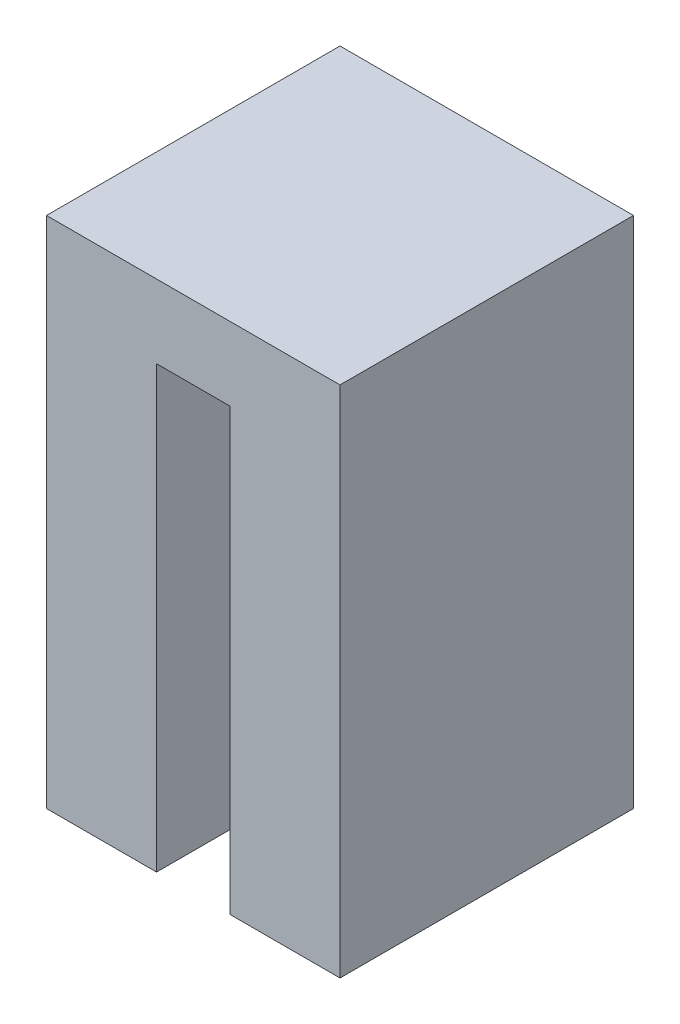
ISO-10303-21;
HEADER;
FILE_DESCRIPTION(('STEP AP214'),'2;1');
FILE_NAME('part.step','',(''),(''),'','','');
FILE_SCHEMA(('AUTOMOTIVE_DESIGN { 1 0 10303 214 1 1 1 1 }'));
ENDSEC;
DATA;
#1=APPLICATION_CONTEXT('core data for automotive mechanical design processes');
#2=APPLICATION_PROTOCOL_DEFINITION('international standard','automotive_design',2000,#1);
#3=PRODUCT_CONTEXT('',#1,'mechanical');
#4=PRODUCT('Part','Part','',(#3));
#5=PRODUCT_RELATED_PRODUCT_CATEGORY('part','',(#4));
#6=PRODUCT_DEFINITION_FORMATION('','',#4);
#7=PRODUCT_DEFINITION_CONTEXT('part definition',#1,'design');
#8=PRODUCT_DEFINITION('design','',#6,#7);
#9=PRODUCT_DEFINITION_SHAPE('','',#8);
#10=(LENGTH_UNIT() NAMED_UNIT(*) SI_UNIT(.MILLI.,.METRE.));
#11=(NAMED_UNIT(*) PLANE_ANGLE_UNIT() SI_UNIT($,.RADIAN.));
#12=(NAMED_UNIT(*) SI_UNIT($,.STERADIAN.) SOLID_ANGLE_UNIT());
#13=UNCERTAINTY_MEASURE_WITH_UNIT(LENGTH_MEASURE(1.E-05),#10,'distance_accuracy_value','');
#14=(GEOMETRIC_REPRESENTATION_CONTEXT(3) GLOBAL_UNCERTAINTY_ASSIGNED_CONTEXT((#13)) GLOBAL_UNIT_ASSIGNED_CONTEXT((#10,
#11,#12)) REPRESENTATION_CONTEXT('',''));
#15=CARTESIAN_POINT('',(0.,0.,0.));
#16=DIRECTION('',(0.,0.,1.));
#17=DIRECTION('',(1.,0.,0.));
#18=AXIS2_PLACEMENT_3D('',#15,#16,#17);
#19=CARTESIAN_POINT('',(100.,-300.,-200.));
#20=DIRECTION('',(1.,0.,0.));
#21=DIRECTION('',(0.,0.,-1.));
#22=AXIS2_PLACEMENT_3D('',#19,#20,#21);
#23=PLANE('',#22);
#24=DIRECTION('',(0.,1.,0.));
#25=VECTOR('',#24,1.);
#26=CARTESIAN_POINT('',(100.,-300.,0.));
#27=LINE('',#26,#25);
#28=CARTESIAN_POINT('',(100.,-300.,0.));
#29=VERTEX_POINT('',#28);
#30=CARTESIAN_POINT('',(100.,49.9999999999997,0.));
#31=VERTEX_POINT('',#30);
#32=EDGE_CURVE('E132',#29,#31,#27,.T.);
#33=ORIENTED_EDGE('',*,*,#32,.F.);
#34=DIRECTION('',(0.,0.,1.));
#35=VECTOR('',#34,1.);
#36=CARTESIAN_POINT('',(100.,-300.,-200.));
#37=LINE('',#36,#35);
#38=CARTESIAN_POINT('',(100.,-300.,-200.));
#39=VERTEX_POINT('',#38);
#40=EDGE_CURVE('E11',#39,#29,#37,.T.);
#41=ORIENTED_EDGE('',*,*,#40,.F.);
#42=DIRECTION('',(0.,1.,0.));
#43=VECTOR('',#42,1.);
#44=CARTESIAN_POINT('',(100.,-300.,-200.));
#45=LINE('',#44,#43);
#46=CARTESIAN_POINT('',(100.,49.9999999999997,-200.));
#47=VERTEX_POINT('',#46);
#48=EDGE_CURVE('E152',#39,#47,#45,.T.);
#49=ORIENTED_EDGE('',*,*,#48,.T.);
#50=DIRECTION('',(0.,0.,1.));
#51=VECTOR('',#50,1.);
#52=CARTESIAN_POINT('',(100.,49.9999999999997,-200.));
#53=LINE('',#52,#51);
#54=EDGE_CURVE('E38',#47,#31,#53,.T.);
#55=ORIENTED_EDGE('',*,*,#54,.T.);
#56=EDGE_LOOP('',(#33,#41,#49,#55));
#57=FACE_BOUND('',#56,.T.);
#58=ADVANCED_FACE('F35',(#57),#23,.T.);
#59=CARTESIAN_POINT('',(100.,-300.,-200.));
#60=DIRECTION('',(0.,-1.,0.));
#61=DIRECTION('',(1.,0.,0.));
#62=AXIS2_PLACEMENT_3D('',#59,#60,#61);
#63=PLANE('',#62);
#64=DIRECTION('',(1.,0.,0.));
#65=VECTOR('',#64,1.);
#66=CARTESIAN_POINT('',(100.,-300.,0.));
#67=LINE('',#66,#65);
#68=CARTESIAN_POINT('',(25.,-300.,0.));
#69=VERTEX_POINT('',#68);
#70=EDGE_CURVE('E150',#69,#29,#67,.T.);
#71=ORIENTED_EDGE('',*,*,#70,.F.);
#72=DIRECTION('',(0.,0.,1.));
#73=VECTOR('',#72,1.);
#74=CARTESIAN_POINT('',(25.,-300.,-200.));
#75=LINE('',#74,#73);
#76=CARTESIAN_POINT('',(25.,-300.,-200.));
#77=VERTEX_POINT('',#76);
#78=EDGE_CURVE('E44',#77,#69,#75,.T.);
#79=ORIENTED_EDGE('',*,*,#78,.F.);
#80=DIRECTION('',(1.,0.,0.));
#81=VECTOR('',#80,1.);
#82=CARTESIAN_POINT('',(100.,-300.,-200.));
#83=LINE('',#82,#81);
#84=EDGE_CURVE('E122',#77,#39,#83,.T.);
#85=ORIENTED_EDGE('',*,*,#84,.T.);
#86=ORIENTED_EDGE('',*,*,#40,.T.);
#87=EDGE_LOOP('',(#71,#79,#85,#86));
#88=FACE_BOUND('',#87,.T.);
#89=ADVANCED_FACE('F164',(#88),#63,.T.);
#90=CARTESIAN_POINT('',(25.,0.,-200.));
#91=DIRECTION('',(-1.,0.,0.));
#92=DIRECTION('',(0.,-1.,0.));
#93=AXIS2_PLACEMENT_3D('',#90,#91,#92);
#94=PLANE('',#93);
#95=DIRECTION('',(0.,-1.,0.));
#96=VECTOR('',#95,1.);
#97=CARTESIAN_POINT('',(25.,0.,0.));
#98=LINE('',#97,#96);
#99=CARTESIAN_POINT('',(25.,0.,0.));
#100=VERTEX_POINT('',#99);
#101=EDGE_CURVE('E109',#100,#69,#98,.T.);
#102=ORIENTED_EDGE('',*,*,#101,.F.);
#103=DIRECTION('',(0.,0.,1.));
#104=VECTOR('',#103,1.);
#105=CARTESIAN_POINT('',(25.,0.,-200.));
#106=LINE('',#105,#104);
#107=CARTESIAN_POINT('',(25.,0.,-200.));
#108=VERTEX_POINT('',#107);
#109=EDGE_CURVE('E104',#108,#100,#106,.T.);
#110=ORIENTED_EDGE('',*,*,#109,.F.);
#111=DIRECTION('',(0.,-1.,0.));
#112=VECTOR('',#111,1.);
#113=CARTESIAN_POINT('',(25.,0.,-200.));
#114=LINE('',#113,#112);
#115=EDGE_CURVE('E107',#108,#77,#114,.T.);
#116=ORIENTED_EDGE('',*,*,#115,.T.);
#117=ORIENTED_EDGE('',*,*,#78,.T.);
#118=EDGE_LOOP('',(#102,#110,#116,#117));
#119=FACE_BOUND('',#118,.T.);
#120=ADVANCED_FACE('F106',(#119),#94,.T.);
#121=CARTESIAN_POINT('',(-25.,0.,-200.));
#122=DIRECTION('',(0.,-1.,0.));
#123=DIRECTION('',(0.,0.,-1.));
#124=AXIS2_PLACEMENT_3D('',#121,#122,#123);
#125=PLANE('',#124);
#126=DIRECTION('',(1.,0.,0.));
#127=VECTOR('',#126,1.);
#128=CARTESIAN_POINT('',(-25.,0.,0.));
#129=LINE('',#128,#127);
#130=CARTESIAN_POINT('',(-25.,0.,0.));
#131=VERTEX_POINT('',#130);
#132=EDGE_CURVE('E147',#131,#100,#129,.T.);
#133=ORIENTED_EDGE('',*,*,#132,.F.);
#134=DIRECTION('',(0.,0.,1.));
#135=VECTOR('',#134,1.);
#136=CARTESIAN_POINT('',(-25.,0.,-200.));
#137=LINE('',#136,#135);
#138=CARTESIAN_POINT('',(-25.,0.,-200.));
#139=VERTEX_POINT('',#138);
#140=EDGE_CURVE('E114',#139,#131,#137,.T.);
#141=ORIENTED_EDGE('',*,*,#140,.F.);
#142=DIRECTION('',(1.,0.,0.));
#143=VECTOR('',#142,1.);
#144=CARTESIAN_POINT('',(-25.,0.,-200.));
#145=LINE('',#144,#143);
#146=EDGE_CURVE('E120',#139,#108,#145,.T.);
#147=ORIENTED_EDGE('',*,*,#146,.T.);
#148=ORIENTED_EDGE('',*,*,#109,.T.);
#149=EDGE_LOOP('',(#133,#141,#147,#148));
#150=FACE_BOUND('',#149,.T.);
#151=ADVANCED_FACE('F124',(#150),#125,.T.);
#152=CARTESIAN_POINT('',(-25.,-300.,-200.));
#153=DIRECTION('',(1.,0.,0.));
#154=DIRECTION('',(0.,1.,0.));
#155=AXIS2_PLACEMENT_3D('',#152,#153,#154);
#156=PLANE('',#155);
#157=DIRECTION('',(0.,1.,0.));
#158=VECTOR('',#157,1.);
#159=CARTESIAN_POINT('',(-25.,-300.,0.));
#160=LINE('',#159,#158);
#161=CARTESIAN_POINT('',(-25.,-300.,0.));
#162=VERTEX_POINT('',#161);
#163=EDGE_CURVE('E144',#162,#131,#160,.T.);
#164=ORIENTED_EDGE('',*,*,#163,.F.);
#165=DIRECTION('',(0.,0.,1.));
#166=VECTOR('',#165,1.);
#167=CARTESIAN_POINT('',(-25.,-300.,-200.));
#168=LINE('',#167,#166);
#169=CARTESIAN_POINT('',(-25.,-300.,-200.));
#170=VERTEX_POINT('',#169);
#171=EDGE_CURVE('E156',#170,#162,#168,.T.);
#172=ORIENTED_EDGE('',*,*,#171,.F.);
#173=DIRECTION('',(0.,1.,0.));
#174=VECTOR('',#173,1.);
#175=CARTESIAN_POINT('',(-25.,-300.,-200.));
#176=LINE('',#175,#174);
#177=EDGE_CURVE('E125',#170,#139,#176,.T.);
#178=ORIENTED_EDGE('',*,*,#177,.T.);
#179=ORIENTED_EDGE('',*,*,#140,.T.);
#180=EDGE_LOOP('',(#164,#172,#178,#179));
#181=FACE_BOUND('',#180,.T.);
#182=ADVANCED_FACE('F177',(#181),#156,.T.);
#183=CARTESIAN_POINT('',(-25.,-300.,-200.));
#184=DIRECTION('',(0.,-1.,0.));
#185=DIRECTION('',(1.,0.,0.));
#186=AXIS2_PLACEMENT_3D('',#183,#184,#185);
#187=PLANE('',#186);
#188=DIRECTION('',(1.,0.,0.));
#189=VECTOR('',#188,1.);
#190=CARTESIAN_POINT('',(-25.,-300.,0.));
#191=LINE('',#190,#189);
#192=CARTESIAN_POINT('',(-100.,-300.,0.));
#193=VERTEX_POINT('',#192);
#194=EDGE_CURVE('E141',#193,#162,#191,.T.);
#195=ORIENTED_EDGE('',*,*,#194,.F.);
#196=DIRECTION('',(0.,0.,1.));
#197=VECTOR('',#196,1.);
#198=CARTESIAN_POINT('',(-100.,-300.,-200.));
#199=LINE('',#198,#197);
#200=CARTESIAN_POINT('',(-100.,-300.,-200.));
#201=VERTEX_POINT('',#200);
#202=EDGE_CURVE('E158',#201,#193,#199,.T.);
#203=ORIENTED_EDGE('',*,*,#202,.F.);
#204=DIRECTION('',(1.,0.,0.));
#205=VECTOR('',#204,1.);
#206=CARTESIAN_POINT('',(-25.,-300.,-200.));
#207=LINE('',#206,#205);
#208=EDGE_CURVE('E127',#201,#170,#207,.T.);
#209=ORIENTED_EDGE('',*,*,#208,.T.);
#210=ORIENTED_EDGE('',*,*,#171,.T.);
#211=EDGE_LOOP('',(#195,#203,#209,#210));
#212=FACE_BOUND('',#211,.T.);
#213=ADVANCED_FACE('F180',(#212),#187,.T.);
#214=CARTESIAN_POINT('',(-100.,-300.,-200.));
#215=DIRECTION('',(-1.,0.,0.));
#216=DIRECTION('',(0.,0.,1.));
#217=AXIS2_PLACEMENT_3D('',#214,#215,#216);
#218=PLANE('',#217);
#219=DIRECTION('',(0.,-1.,0.));
#220=VECTOR('',#219,1.);
#221=CARTESIAN_POINT('',(-100.,-300.,0.));
#222=LINE('',#221,#220);
#223=CARTESIAN_POINT('',(-100.,49.9999999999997,0.));
#224=VERTEX_POINT('',#223);
#225=EDGE_CURVE('E138',#224,#193,#222,.T.);
#226=ORIENTED_EDGE('',*,*,#225,.F.);
#227=DIRECTION('',(0.,0.,1.));
#228=VECTOR('',#227,1.);
#229=CARTESIAN_POINT('',(-100.,49.9999999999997,-200.));
#230=LINE('',#229,#228);
#231=CARTESIAN_POINT('',(-100.,49.9999999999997,-200.));
#232=VERTEX_POINT('',#231);
#233=EDGE_CURVE('E159',#232,#224,#230,.T.);
#234=ORIENTED_EDGE('',*,*,#233,.F.);
#235=DIRECTION('',(0.,-1.,0.));
#236=VECTOR('',#235,1.);
#237=CARTESIAN_POINT('',(-100.,-300.,-200.));
#238=LINE('',#237,#236);
#239=EDGE_CURVE('E255',#232,#201,#238,.T.);
#240=ORIENTED_EDGE('',*,*,#239,.T.);
#241=ORIENTED_EDGE('',*,*,#202,.T.);
#242=EDGE_LOOP('',(#226,#234,#240,#241));
#243=FACE_BOUND('',#242,.T.);
#244=ADVANCED_FACE('F184',(#243),#218,.T.);
#245=CARTESIAN_POINT('',(100.,49.9999999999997,-200.));
#246=DIRECTION('',(0.,1.,0.));
#247=DIRECTION('',(0.,0.,1.));
#248=AXIS2_PLACEMENT_3D('',#245,#246,#247);
#249=PLANE('',#248);
#250=DIRECTION('',(-1.,0.,0.));
#251=VECTOR('',#250,1.);
#252=CARTESIAN_POINT('',(100.,49.9999999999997,0.));
#253=LINE('',#252,#251);
#254=EDGE_CURVE('E135',#31,#224,#253,.T.);
#255=ORIENTED_EDGE('',*,*,#254,.F.);
#256=ORIENTED_EDGE('',*,*,#54,.F.);
#257=DIRECTION('',(-1.,0.,0.));
#258=VECTOR('',#257,1.);
#259=CARTESIAN_POINT('',(100.,49.9999999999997,-200.));
#260=LINE('',#259,#258);
#261=EDGE_CURVE('E256',#47,#232,#260,.T.);
#262=ORIENTED_EDGE('',*,*,#261,.T.);
#263=ORIENTED_EDGE('',*,*,#233,.T.);
#264=EDGE_LOOP('',(#255,#256,#262,#263));
#265=FACE_BOUND('',#264,.T.);
#266=ADVANCED_FACE('F161',(#265),#249,.T.);
#267=CARTESIAN_POINT('',(0.,0.,-200.));
#268=DIRECTION('',(0.,0.,1.));
#269=DIRECTION('',(1.,0.,0.));
#270=AXIS2_PLACEMENT_3D('',#267,#268,#269);
#271=PLANE('',#270);
#272=ORIENTED_EDGE('',*,*,#48,.F.);
#273=ORIENTED_EDGE('',*,*,#84,.F.);
#274=ORIENTED_EDGE('',*,*,#115,.F.);
#275=ORIENTED_EDGE('',*,*,#146,.F.);
#276=ORIENTED_EDGE('',*,*,#177,.F.);
#277=ORIENTED_EDGE('',*,*,#208,.F.);
#278=ORIENTED_EDGE('',*,*,#239,.F.);
#279=ORIENTED_EDGE('',*,*,#261,.F.);
#280=EDGE_LOOP('',(#272,#273,#274,#275,#276,#277,#278,#279));
#281=FACE_BOUND('',#280,.T.);
#282=ADVANCED_FACE('F118',(#281),#271,.F.);
#283=CARTESIAN_POINT('',(0.,0.,0.));
#284=DIRECTION('',(0.,0.,1.));
#285=DIRECTION('',(1.,0.,0.));
#286=AXIS2_PLACEMENT_3D('',#283,#284,#285);
#287=PLANE('',#286);
#288=ORIENTED_EDGE('',*,*,#32,.T.);
#289=ORIENTED_EDGE('',*,*,#254,.T.);
#290=ORIENTED_EDGE('',*,*,#225,.T.);
#291=ORIENTED_EDGE('',*,*,#194,.T.);
#292=ORIENTED_EDGE('',*,*,#163,.T.);
#293=ORIENTED_EDGE('',*,*,#132,.T.);
#294=ORIENTED_EDGE('',*,*,#101,.T.);
#295=ORIENTED_EDGE('',*,*,#70,.T.);
#296=EDGE_LOOP('',(#288,#289,#290,#291,#292,#293,#294,#295));
#297=FACE_BOUND('',#296,.T.);
#298=ADVANCED_FACE('F163',(#297),#287,.T.);
#299=CLOSED_SHELL('',(#58,#89,#120,#151,#182,#213,#244,#266,#282,#298));
#300=MANIFOLD_SOLID_BREP('B2',#299);
#301=ADVANCED_BREP_SHAPE_REPRESENTATION('',(#18,#300),#14);
#302=SHAPE_DEFINITION_REPRESENTATION(#9,#301);
ENDSEC;
END-ISO-10303-21;
